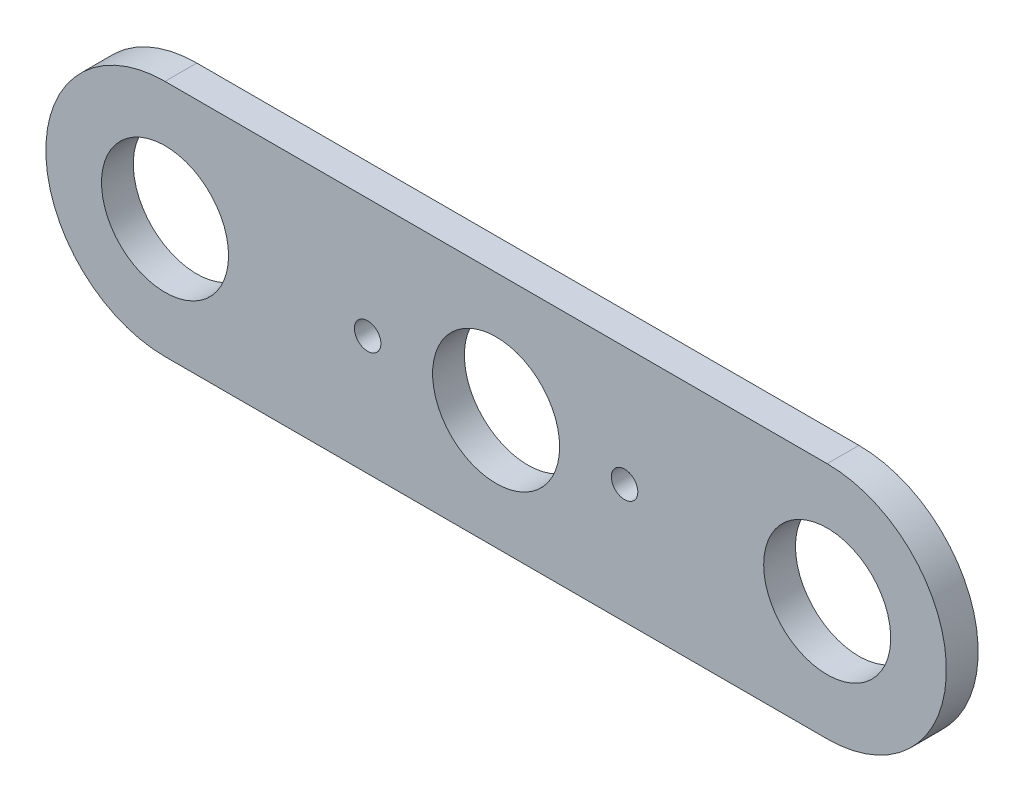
ISO-10303-21;
HEADER;
FILE_DESCRIPTION(('STEP AP214'),'2;1');
FILE_NAME('part.step','',(''),(''),'','','');
FILE_SCHEMA(('AUTOMOTIVE_DESIGN { 1 0 10303 214 1 1 1 1 }'));
ENDSEC;
DATA;
#1=APPLICATION_CONTEXT('core data for automotive mechanical design processes');
#2=APPLICATION_PROTOCOL_DEFINITION('international standard','automotive_design',2000,#1);
#3=PRODUCT_CONTEXT('',#1,'mechanical');
#4=PRODUCT('Part','Part','',(#3));
#5=PRODUCT_RELATED_PRODUCT_CATEGORY('part','',(#4));
#6=PRODUCT_DEFINITION_FORMATION('','',#4);
#7=PRODUCT_DEFINITION_CONTEXT('part definition',#1,'design');
#8=PRODUCT_DEFINITION('design','',#6,#7);
#9=PRODUCT_DEFINITION_SHAPE('','',#8);
#10=(LENGTH_UNIT() NAMED_UNIT(*) SI_UNIT(.MILLI.,.METRE.));
#11=(NAMED_UNIT(*) PLANE_ANGLE_UNIT() SI_UNIT($,.RADIAN.));
#12=(NAMED_UNIT(*) SI_UNIT($,.STERADIAN.) SOLID_ANGLE_UNIT());
#13=UNCERTAINTY_MEASURE_WITH_UNIT(LENGTH_MEASURE(1.E-05),#10,'distance_accuracy_value','');
#14=(GEOMETRIC_REPRESENTATION_CONTEXT(3) GLOBAL_UNCERTAINTY_ASSIGNED_CONTEXT((#13)) GLOBAL_UNIT_ASSIGNED_CONTEXT((#10,
#11,#12)) REPRESENTATION_CONTEXT('',''));
#15=CARTESIAN_POINT('',(0.,0.,0.));
#16=DIRECTION('',(0.,0.,1.));
#17=DIRECTION('',(1.,0.,0.));
#18=AXIS2_PLACEMENT_3D('',#15,#16,#17);
#19=CARTESIAN_POINT('',(62.5,0.,6.));
#20=DIRECTION('',(0.,0.,1.));
#21=DIRECTION('',(1.,0.,0.));
#22=AXIS2_PLACEMENT_3D('',#19,#20,#21);
#23=PLANE('',#22);
#24=CARTESIAN_POINT('',(-24.25,0.,6.));
#25=DIRECTION('',(0.,0.,1.));
#26=DIRECTION('',(1.,0.,0.));
#27=AXIS2_PLACEMENT_3D('',#24,#25,#26);
#28=CIRCLE('',#27,2.49999999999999);
#29=CARTESIAN_POINT('',(-21.75,0.,6.));
#30=VERTEX_POINT('',#29);
#31=EDGE_CURVE('E116',#30,#30,#28,.T.);
#32=ORIENTED_EDGE('',*,*,#31,.F.);
#33=EDGE_LOOP('',(#32));
#34=FACE_BOUND('',#33,.T.);
#35=CARTESIAN_POINT('',(24.25,0.,6.));
#36=DIRECTION('',(0.,0.,1.));
#37=DIRECTION('',(-1.,0.,0.));
#38=AXIS2_PLACEMENT_3D('',#35,#36,#37);
#39=CIRCLE('',#38,2.50000000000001);
#40=CARTESIAN_POINT('',(21.75,0.,6.));
#41=VERTEX_POINT('',#40);
#42=EDGE_CURVE('E122',#41,#41,#39,.T.);
#43=ORIENTED_EDGE('',*,*,#42,.F.);
#44=EDGE_LOOP('',(#43));
#45=FACE_BOUND('',#44,.T.);
#46=CARTESIAN_POINT('',(62.5,0.,6.));
#47=DIRECTION('',(0.,0.,1.));
#48=DIRECTION('',(-1.,0.,0.));
#49=AXIS2_PLACEMENT_3D('',#46,#47,#48);
#50=CIRCLE('',#49,11.99);
#51=CARTESIAN_POINT('',(50.51,0.,6.));
#52=VERTEX_POINT('',#51);
#53=EDGE_CURVE('E135',#52,#52,#50,.T.);
#54=ORIENTED_EDGE('',*,*,#53,.F.);
#55=EDGE_LOOP('',(#54));
#56=FACE_BOUND('',#55,.T.);
#57=CARTESIAN_POINT('',(62.5,0.,6.));
#58=DIRECTION('',(0.,0.,1.));
#59=DIRECTION('',(1.,0.,0.));
#60=AXIS2_PLACEMENT_3D('',#57,#58,#59);
#61=CIRCLE('',#60,22.5);
#62=CARTESIAN_POINT('',(62.5,-22.5,6.));
#63=VERTEX_POINT('',#62);
#64=CARTESIAN_POINT('',(62.5,22.5,6.));
#65=VERTEX_POINT('',#64);
#66=EDGE_CURVE('E93',#63,#65,#61,.T.);
#67=ORIENTED_EDGE('',*,*,#66,.T.);
#68=DIRECTION('',(-1.,0.,0.));
#69=VECTOR('',#68,1.);
#70=CARTESIAN_POINT('',(-62.5,22.5,6.));
#71=LINE('',#70,#69);
#72=CARTESIAN_POINT('',(-62.5,22.5,6.));
#73=VERTEX_POINT('',#72);
#74=EDGE_CURVE('E88',#65,#73,#71,.T.);
#75=ORIENTED_EDGE('',*,*,#74,.T.);
#76=CARTESIAN_POINT('',(-62.5,0.,6.));
#77=DIRECTION('',(0.,0.,1.));
#78=DIRECTION('',(-1.,0.,0.));
#79=AXIS2_PLACEMENT_3D('',#76,#77,#78);
#80=CIRCLE('',#79,22.5);
#81=CARTESIAN_POINT('',(-62.5,-22.5,6.));
#82=VERTEX_POINT('',#81);
#83=EDGE_CURVE('E91',#73,#82,#80,.T.);
#84=ORIENTED_EDGE('',*,*,#83,.T.);
#85=DIRECTION('',(1.,0.,0.));
#86=VECTOR('',#85,1.);
#87=CARTESIAN_POINT('',(-62.5,-22.5,6.));
#88=LINE('',#87,#86);
#89=EDGE_CURVE('E58',#82,#63,#88,.T.);
#90=ORIENTED_EDGE('',*,*,#89,.T.);
#91=EDGE_LOOP('',(#67,#75,#84,#90));
#92=FACE_BOUND('',#91,.T.);
#93=CARTESIAN_POINT('',(-62.5,0.,6.));
#94=DIRECTION('',(0.,0.,1.));
#95=DIRECTION('',(1.,0.,0.));
#96=AXIS2_PLACEMENT_3D('',#93,#94,#95);
#97=CIRCLE('',#96,11.99);
#98=CARTESIAN_POINT('',(-50.51,0.,6.));
#99=VERTEX_POINT('',#98);
#100=EDGE_CURVE('E109',#99,#99,#97,.T.);
#101=ORIENTED_EDGE('',*,*,#100,.F.);
#102=EDGE_LOOP('',(#101));
#103=FACE_BOUND('',#102,.T.);
#104=CARTESIAN_POINT('',(0.,0.,6.));
#105=DIRECTION('',(0.,0.,1.));
#106=DIRECTION('',(1.,0.,0.));
#107=AXIS2_PLACEMENT_3D('',#104,#105,#106);
#108=CIRCLE('',#107,11.99);
#109=CARTESIAN_POINT('',(11.99,0.,6.));
#110=VERTEX_POINT('',#109);
#111=EDGE_CURVE('E129',#110,#110,#108,.T.);
#112=ORIENTED_EDGE('',*,*,#111,.F.);
#113=EDGE_LOOP('',(#112));
#114=FACE_BOUND('',#113,.T.);
#115=ADVANCED_FACE('F39',(#34,#45,#56,#92,#103,#114),#23,.T.);
#116=CARTESIAN_POINT('',(62.5,0.,0.));
#117=DIRECTION('',(0.,0.,1.));
#118=DIRECTION('',(1.,0.,0.));
#119=AXIS2_PLACEMENT_3D('',#116,#117,#118);
#120=PLANE('',#119);
#121=CARTESIAN_POINT('',(-24.25,0.,0.));
#122=DIRECTION('',(0.,0.,1.));
#123=DIRECTION('',(1.,0.,0.));
#124=AXIS2_PLACEMENT_3D('',#121,#122,#123);
#125=CIRCLE('',#124,2.49999999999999);
#126=CARTESIAN_POINT('',(-21.75,0.,0.));
#127=VERTEX_POINT('',#126);
#128=EDGE_CURVE('E43',#127,#127,#125,.T.);
#129=ORIENTED_EDGE('',*,*,#128,.T.);
#130=EDGE_LOOP('',(#129));
#131=FACE_BOUND('',#130,.T.);
#132=CARTESIAN_POINT('',(24.25,0.,0.));
#133=DIRECTION('',(0.,0.,1.));
#134=DIRECTION('',(1.,0.,0.));
#135=AXIS2_PLACEMENT_3D('',#132,#133,#134);
#136=CIRCLE('',#135,2.50000000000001);
#137=CARTESIAN_POINT('',(26.75,0.,0.));
#138=VERTEX_POINT('',#137);
#139=EDGE_CURVE('E114',#138,#138,#136,.T.);
#140=ORIENTED_EDGE('',*,*,#139,.T.);
#141=EDGE_LOOP('',(#140));
#142=FACE_BOUND('',#141,.T.);
#143=CARTESIAN_POINT('',(62.5,0.,0.));
#144=DIRECTION('',(0.,0.,1.));
#145=DIRECTION('',(1.,0.,0.));
#146=AXIS2_PLACEMENT_3D('',#143,#144,#145);
#147=CIRCLE('',#146,22.5);
#148=CARTESIAN_POINT('',(62.5,-22.5,0.));
#149=VERTEX_POINT('',#148);
#150=CARTESIAN_POINT('',(62.5,22.5,0.));
#151=VERTEX_POINT('',#150);
#152=EDGE_CURVE('E106',#149,#151,#147,.T.);
#153=ORIENTED_EDGE('',*,*,#152,.F.);
#154=DIRECTION('',(1.,0.,0.));
#155=VECTOR('',#154,1.);
#156=CARTESIAN_POINT('',(-62.5,-22.5,0.));
#157=LINE('',#156,#155);
#158=CARTESIAN_POINT('',(-62.5,-22.5,0.));
#159=VERTEX_POINT('',#158);
#160=EDGE_CURVE('E81',#159,#149,#157,.T.);
#161=ORIENTED_EDGE('',*,*,#160,.F.);
#162=CARTESIAN_POINT('',(-62.5,0.,0.));
#163=DIRECTION('',(0.,0.,1.));
#164=DIRECTION('',(-1.,0.,0.));
#165=AXIS2_PLACEMENT_3D('',#162,#163,#164);
#166=CIRCLE('',#165,22.5);
#167=CARTESIAN_POINT('',(-62.5,22.5,0.));
#168=VERTEX_POINT('',#167);
#169=EDGE_CURVE('E75',#168,#159,#166,.T.);
#170=ORIENTED_EDGE('',*,*,#169,.F.);
#171=DIRECTION('',(-1.,0.,0.));
#172=VECTOR('',#171,1.);
#173=CARTESIAN_POINT('',(-62.5,22.5,0.));
#174=LINE('',#173,#172);
#175=EDGE_CURVE('E97',#151,#168,#174,.T.);
#176=ORIENTED_EDGE('',*,*,#175,.F.);
#177=EDGE_LOOP('',(#153,#161,#170,#176));
#178=FACE_BOUND('',#177,.T.);
#179=CARTESIAN_POINT('',(-62.5,0.,0.));
#180=DIRECTION('',(0.,0.,1.));
#181=DIRECTION('',(1.,0.,0.));
#182=AXIS2_PLACEMENT_3D('',#179,#180,#181);
#183=CIRCLE('',#182,11.99);
#184=CARTESIAN_POINT('',(-50.51,0.,0.));
#185=VERTEX_POINT('',#184);
#186=EDGE_CURVE('E138',#185,#185,#183,.T.);
#187=ORIENTED_EDGE('',*,*,#186,.T.);
#188=EDGE_LOOP('',(#187));
#189=FACE_BOUND('',#188,.T.);
#190=CARTESIAN_POINT('',(62.5,0.,0.));
#191=DIRECTION('',(0.,0.,1.));
#192=DIRECTION('',(-1.,0.,0.));
#193=AXIS2_PLACEMENT_3D('',#190,#191,#192);
#194=CIRCLE('',#193,11.99);
#195=CARTESIAN_POINT('',(50.51,0.,0.));
#196=VERTEX_POINT('',#195);
#197=EDGE_CURVE('E132',#196,#196,#194,.T.);
#198=ORIENTED_EDGE('',*,*,#197,.T.);
#199=EDGE_LOOP('',(#198));
#200=FACE_BOUND('',#199,.T.);
#201=CARTESIAN_POINT('',(0.,0.,0.));
#202=DIRECTION('',(0.,0.,1.));
#203=DIRECTION('',(1.,0.,0.));
#204=AXIS2_PLACEMENT_3D('',#201,#202,#203);
#205=CIRCLE('',#204,11.99);
#206=CARTESIAN_POINT('',(11.99,0.,0.));
#207=VERTEX_POINT('',#206);
#208=EDGE_CURVE('E120',#207,#207,#205,.T.);
#209=ORIENTED_EDGE('',*,*,#208,.T.);
#210=EDGE_LOOP('',(#209));
#211=FACE_BOUND('',#210,.T.);
#212=ADVANCED_FACE('F146',(#131,#142,#178,#189,#200,#211),#120,.F.);
#213=CARTESIAN_POINT('',(62.5,0.,6.));
#214=DIRECTION('',(0.,0.,-1.));
#215=DIRECTION('',(-1.,0.,0.));
#216=AXIS2_PLACEMENT_3D('',#213,#214,#215);
#217=CYLINDRICAL_SURFACE('',#216,22.5);
#218=ORIENTED_EDGE('',*,*,#152,.T.);
#219=DIRECTION('',(0.,0.,-1.));
#220=VECTOR('',#219,1.);
#221=CARTESIAN_POINT('',(62.5,22.5,6.));
#222=LINE('',#221,#220);
#223=EDGE_CURVE('E11',#65,#151,#222,.T.);
#224=ORIENTED_EDGE('',*,*,#223,.F.);
#225=ORIENTED_EDGE('',*,*,#66,.F.);
#226=DIRECTION('',(0.,0.,-1.));
#227=VECTOR('',#226,1.);
#228=CARTESIAN_POINT('',(62.5,-22.5,6.));
#229=LINE('',#228,#227);
#230=EDGE_CURVE('E102',#63,#149,#229,.T.);
#231=ORIENTED_EDGE('',*,*,#230,.T.);
#232=EDGE_LOOP('',(#218,#224,#225,#231));
#233=FACE_BOUND('',#232,.T.);
#234=ADVANCED_FACE('F41',(#233),#217,.T.);
#235=CARTESIAN_POINT('',(-62.5,22.5,6.));
#236=DIRECTION('',(0.,-1.,0.));
#237=DIRECTION('',(1.,0.,0.));
#238=AXIS2_PLACEMENT_3D('',#235,#236,#237);
#239=PLANE('',#238);
#240=ORIENTED_EDGE('',*,*,#175,.T.);
#241=DIRECTION('',(0.,0.,-1.));
#242=VECTOR('',#241,1.);
#243=CARTESIAN_POINT('',(-62.5,22.5,6.));
#244=LINE('',#243,#242);
#245=EDGE_CURVE('E49',#73,#168,#244,.T.);
#246=ORIENTED_EDGE('',*,*,#245,.F.);
#247=ORIENTED_EDGE('',*,*,#74,.F.);
#248=ORIENTED_EDGE('',*,*,#223,.T.);
#249=EDGE_LOOP('',(#240,#246,#247,#248));
#250=FACE_BOUND('',#249,.T.);
#251=ADVANCED_FACE('F96',(#250),#239,.F.);
#252=CARTESIAN_POINT('',(-62.5,0.,6.));
#253=DIRECTION('',(0.,0.,-1.));
#254=DIRECTION('',(-1.,0.,0.));
#255=AXIS2_PLACEMENT_3D('',#252,#253,#254);
#256=CYLINDRICAL_SURFACE('',#255,22.5);
#257=ORIENTED_EDGE('',*,*,#169,.T.);
#258=DIRECTION('',(0.,0.,-1.));
#259=VECTOR('',#258,1.);
#260=CARTESIAN_POINT('',(-62.5,-22.5,6.));
#261=LINE('',#260,#259);
#262=EDGE_CURVE('E98',#82,#159,#261,.T.);
#263=ORIENTED_EDGE('',*,*,#262,.F.);
#264=ORIENTED_EDGE('',*,*,#83,.F.);
#265=ORIENTED_EDGE('',*,*,#245,.T.);
#266=EDGE_LOOP('',(#257,#263,#264,#265));
#267=FACE_BOUND('',#266,.T.);
#268=ADVANCED_FACE('F100',(#267),#256,.T.);
#269=CARTESIAN_POINT('',(-62.5,-22.5,6.));
#270=DIRECTION('',(0.,1.,0.));
#271=DIRECTION('',(-1.,0.,0.));
#272=AXIS2_PLACEMENT_3D('',#269,#270,#271);
#273=PLANE('',#272);
#274=ORIENTED_EDGE('',*,*,#160,.T.);
#275=ORIENTED_EDGE('',*,*,#230,.F.);
#276=ORIENTED_EDGE('',*,*,#89,.F.);
#277=ORIENTED_EDGE('',*,*,#262,.T.);
#278=EDGE_LOOP('',(#274,#275,#276,#277));
#279=FACE_BOUND('',#278,.T.);
#280=ADVANCED_FACE('F152',(#279),#273,.F.);
#281=CARTESIAN_POINT('',(-62.5,0.,6.));
#282=DIRECTION('',(0.,0.,-1.));
#283=DIRECTION('',(-1.,0.,0.));
#284=AXIS2_PLACEMENT_3D('',#281,#282,#283);
#285=CYLINDRICAL_SURFACE('',#284,11.99);
#286=ORIENTED_EDGE('',*,*,#100,.T.);
#287=EDGE_LOOP('',(#286));
#288=FACE_BOUND('',#287,.T.);
#289=ORIENTED_EDGE('',*,*,#186,.F.);
#290=EDGE_LOOP('',(#289));
#291=FACE_BOUND('',#290,.T.);
#292=ADVANCED_FACE('F149',(#288,#291),#285,.F.);
#293=CARTESIAN_POINT('',(62.5,0.,6.));
#294=DIRECTION('',(0.,0.,-1.));
#295=DIRECTION('',(-1.,0.,0.));
#296=AXIS2_PLACEMENT_3D('',#293,#294,#295);
#297=CYLINDRICAL_SURFACE('',#296,11.99);
#298=ORIENTED_EDGE('',*,*,#53,.T.);
#299=EDGE_LOOP('',(#298));
#300=FACE_BOUND('',#299,.T.);
#301=ORIENTED_EDGE('',*,*,#197,.F.);
#302=EDGE_LOOP('',(#301));
#303=FACE_BOUND('',#302,.T.);
#304=ADVANCED_FACE('F151',(#300,#303),#297,.F.);
#305=CARTESIAN_POINT('',(0.,0.,6.));
#306=DIRECTION('',(0.,0.,-1.));
#307=DIRECTION('',(-1.,0.,0.));
#308=AXIS2_PLACEMENT_3D('',#305,#306,#307);
#309=CYLINDRICAL_SURFACE('',#308,11.99);
#310=ORIENTED_EDGE('',*,*,#111,.T.);
#311=EDGE_LOOP('',(#310));
#312=FACE_BOUND('',#311,.T.);
#313=ORIENTED_EDGE('',*,*,#208,.F.);
#314=EDGE_LOOP('',(#313));
#315=FACE_BOUND('',#314,.T.);
#316=ADVANCED_FACE('F159',(#312,#315),#309,.F.);
#317=CARTESIAN_POINT('',(24.25,0.,-4.));
#318=DIRECTION('',(0.,0.,1.));
#319=DIRECTION('',(1.,0.,0.));
#320=AXIS2_PLACEMENT_3D('',#317,#318,#319);
#321=CYLINDRICAL_SURFACE('',#320,2.50000000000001);
#322=ORIENTED_EDGE('',*,*,#42,.T.);
#323=EDGE_LOOP('',(#322));
#324=FACE_BOUND('',#323,.T.);
#325=ORIENTED_EDGE('',*,*,#139,.F.);
#326=EDGE_LOOP('',(#325));
#327=FACE_BOUND('',#326,.T.);
#328=ADVANCED_FACE('F223',(#324,#327),#321,.F.);
#329=CARTESIAN_POINT('',(-24.25,0.,-4.));
#330=DIRECTION('',(0.,0.,1.));
#331=DIRECTION('',(1.,0.,0.));
#332=AXIS2_PLACEMENT_3D('',#329,#330,#331);
#333=CYLINDRICAL_SURFACE('',#332,2.49999999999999);
#334=ORIENTED_EDGE('',*,*,#31,.T.);
#335=EDGE_LOOP('',(#334));
#336=FACE_BOUND('',#335,.T.);
#337=ORIENTED_EDGE('',*,*,#128,.F.);
#338=EDGE_LOOP('',(#337));
#339=FACE_BOUND('',#338,.T.);
#340=ADVANCED_FACE('F233',(#336,#339),#333,.F.);
#341=CLOSED_SHELL('',(#115,#212,#234,#251,#268,#280,#292,#304,#316,#328,#340));
#342=MANIFOLD_SOLID_BREP('B2',#341);
#343=ADVANCED_BREP_SHAPE_REPRESENTATION('',(#18,#342),#14);
#344=SHAPE_DEFINITION_REPRESENTATION(#9,#343);
ENDSEC;
END-ISO-10303-21;
